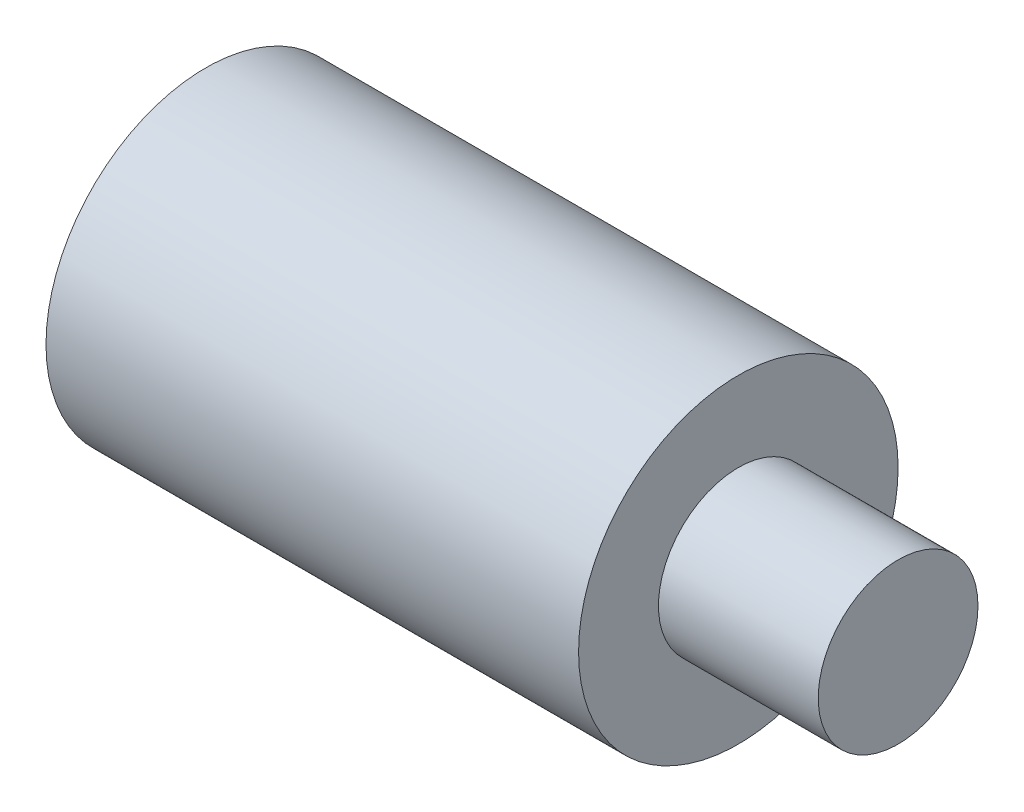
from build123d import *

# Parameters (mm, degrees)
SKETCH1_R           = 30
BOSS_EXTRUDE1_DEPTH = 50
SKETCH2_R           = 15
BOSS_EXTRUDE2_DEPTH = 30


with BuildPart() as part:
    # Sketch1 → Boss-Extrude1 (new, symmetric)
    with BuildSketch(Plane(origin=(0, 0, 0), x_dir=(0, 0, -1), z_dir=(1, 0, 0))):
        Circle(SKETCH1_R)
    extrude(amount=BOSS_EXTRUDE1_DEPTH, both=True)

    # Sketch2 → Boss-Extrude2 (add)
    with BuildSketch(Plane(origin=(50, 0, 0), x_dir=(0, 0, -1), z_dir=(1, 0, 0))):
        Circle(SKETCH2_R)
    extrude(amount=BOSS_EXTRUDE2_DEPTH)


solid = part.part
